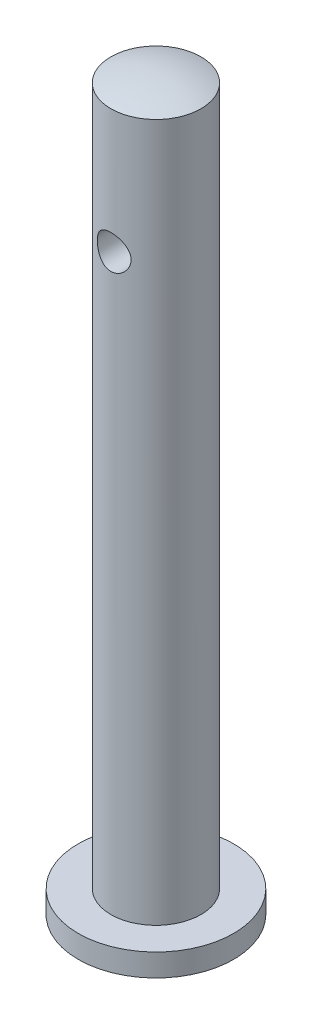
from build123d import *

# Parameters (mm, degrees)
ENL_V_MAT_EXTRU_1_DEPTH      = 10
ENL_V_MAT_EXTRU_1_DEPTH_BACK = 102.307484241
ESQUISSE2_R                  = 1.5


with BuildPart() as part:
    # Esquisse1 → Base-R_volution (revolve)
    with BuildSketch(Plane.XY, mode=Mode.PRIVATE) as base_r_volution_sk:
        with BuildLine():
            Line((-78.152062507, 59.673607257), (-78.152062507, -2.310272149))
            Line((-78.152062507, -2.310272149), (-81.053508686, -2.310272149))
            Line((-81.053508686, -2.310272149), (-81.053508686, -4.310272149))
            ThreePointArc((-81.053508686, -4.310272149), (-77.686432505, -5.452269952), (-74.152062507, -5.839038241))
            Line((-74.152062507, -5.839038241), (-74.152062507, 60.381331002))
            ThreePointArc((-74.152062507, 60.381331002), (-76.18312583, 60.203036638), (-78.152062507, 59.673607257))
        make_face()
    revolve(base_r_volution_sk.sketch.rotate(Axis((-74.152062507, 66.409844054, 0), (0, -1, 0)), 270), axis=Axis((-74.152062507, 66.409844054, 0), (0, -1, 0)))

    # Esquisse2 → Enl_v. mat.-Extru.1 (cut, two sides: drawn at the far end of the back side and taken through both)
    with BuildSketch(Plane.XY.offset(-ENL_V_MAT_EXTRU_1_DEPTH_BACK)):
        with Locations((-74.152062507, 48.65570802)):
            Circle(ESQUISSE2_R)
    extrude(amount=ENL_V_MAT_EXTRU_1_DEPTH + ENL_V_MAT_EXTRU_1_DEPTH_BACK, mode=Mode.SUBTRACT)


solid = part.part
